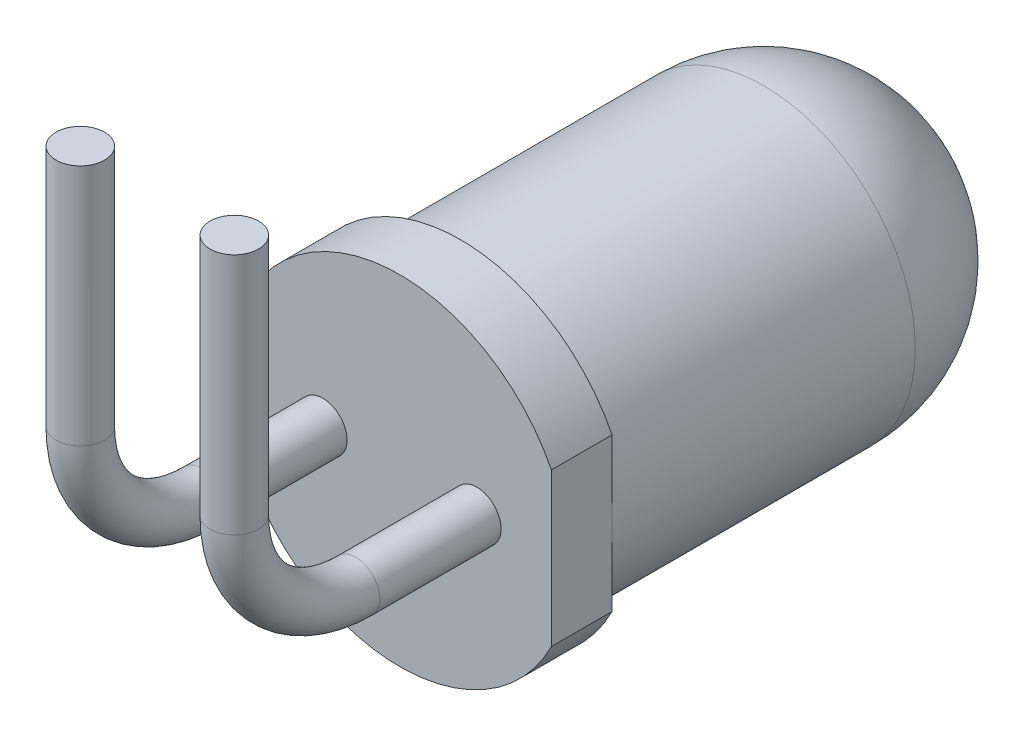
from build123d import *

# Parameters (mm, degrees)
ESQUISSE1_R          = 2.5
BASE_EXTRUSION_DEPTH = 8.5
BOSS_EXTRU_1_DEPTH   = 1
CONG_1_R             = 2.5
ESQUISSE3_R          = 0.4


with BuildPart() as part:
    # Esquisse1 → Base-Extrusion (new body)
    with BuildSketch(Plane.XY):
        Circle(ESQUISSE1_R)
    extrude(amount=BASE_EXTRUSION_DEPTH)

    # Esquisse2 → Boss.-Extru.1 (add)
    with BuildSketch(Plane.XY.offset(8.5)):
        with BuildLine():
            Line((2.5, 1.260952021), (2.5, -1.260952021))
            ThreePointArc((2.5, -1.260952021), (-2.8, 0), (2.5, 1.260952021))
        make_face()
    extrude(amount=-BOSS_EXTRU_1_DEPTH)

    # Cong_1
    cong_1_edges = [part.edges().sort_by_distance(p)[0] for p in [
        (-2.5, 0, 0),
    ]]
    fillet(cong_1_edges, radius=CONG_1_R)

    # Balayage1: sweep along a path in Esquisse5
    with BuildLine(Plane(origin=(1.27, 0, 0), x_dir=(0, 0, -1), z_dir=(1, 0, 0))) as balayage1_path:
        Line((-8.5, 0), (-10.5, 0))
        ThreePointArc((-10.5, 0), (-11.914213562, 0.585786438), (-12.5, 2))
        Line((-12.5, 2), (-12.5, 6))
    # Esquisse3 → Balayage1 (sweep)
    with BuildSketch(Plane.XY.offset(8.5)):
        with Locations((1.27, 0)):
            Circle(ESQUISSE3_R)
    balayage1 = sweep(path=balayage1_path.line)

    # Sym_trie1: Balayage1 across plane
    add(balayage1.mirror(Plane(origin=(0, 0, 0), x_dir=(0, 0, 1), z_dir=(1, 0, 0))))


solid = part.part
